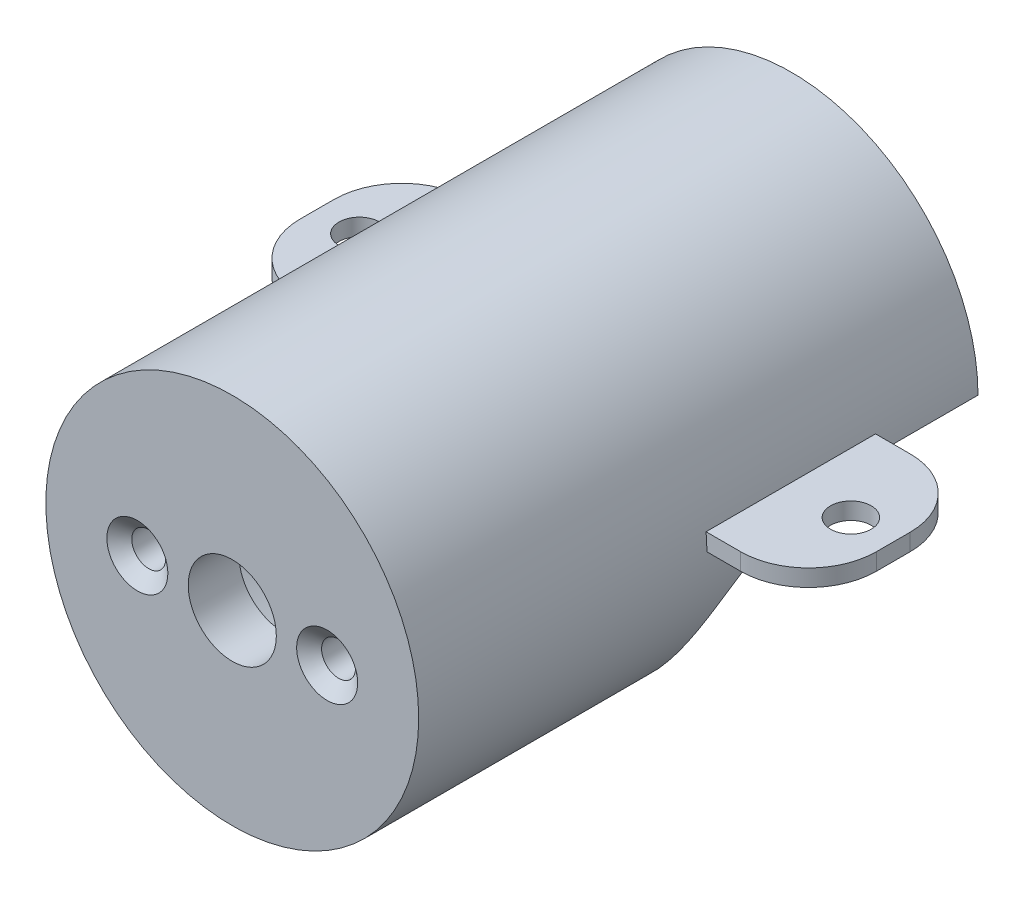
from build123d import *

# Parameters (mm, degrees)
SKETCH1_R                                         = 12.7
BOSS_EXTRUDE1_DEPTH                               = 3.81
SKETCH2_R                                         = 3.302
SKETCH2_R_2                                       = 1.27
CUT_EXTRUDE1_DEPTH                                = 19.360177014
CSK_FOR_0_FLAT_HEAD_MACHINE_SCREW_100_D           = 2.54
CSK_FOR_0_FLAT_HEAD_MACHINE_SCREW_100_CSINK_D     = 4.572
CSK_FOR_0_FLAT_HEAD_MACHINE_SCREW_100_CSINK_ANGLE = 100
CSK_FOR_0_FLAT_HEAD_MACHINE_SCREW_2_D             = 2.54
CSK_FOR_0_FLAT_HEAD_MACHINE_SCREW_2_CSINK_D       = 4.572
CSK_FOR_0_FLAT_HEAD_MACHINE_SCREW_2_CSINK_ANGLE   = 100
BOSS_EXTRUDE4_START                               = -41.91
SKETCH8_R                                         = 13.97
SKETCH8_R_2                                       = 12.7
BOSS_EXTRUDE4_DEPTH                               = 41.91
CUT_EXTRUDE2_DEPTH                                = 43.917732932
CUT_EXTRUDE2_DEPTH_BACK                           = 43.917732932
SKETCH9_W                                         = 10.082430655
SKETCH9_H                                         = 15.310655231
BOSS_EXTRUDE5_DEPTH                               = 1.27
CUT_EXTRUDE3_DEPTH                                = 46.96628112
CUT_EXTRUDE3_DEPTH_BACK                           = 46.96628112
SKETCH12_R                                        = 1.524
CUT_EXTRUDE4_DEPTH                                = 47.368046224


with BuildPart() as part:
    # Sketch1 → Boss-Extrude1 (new body)
    with BuildSketch(Plane.XY):
        with Locations(Location((0, 0, 0), (0, 0, 180))):
            Circle(SKETCH1_R)
    extrude(amount=BOSS_EXTRUDE1_DEPTH)

    # Sketch2 → Cut-Extrude1 (cut, through all)
    with BuildSketch(Plane.XY.offset(3.81)):
        Circle(SKETCH2_R)
        with Locations((-7.112, 0)):
            Circle(SKETCH2_R_2)
        with Locations((7.112, 0)):
            Circle(SKETCH2_R_2)
    extrude(amount=-CUT_EXTRUDE1_DEPTH, mode=Mode.SUBTRACT)

    # CSK for _0 Flat Head Machine Screw _100 (through all)
    with Locations(Plane(origin=(-7.112, 0, 3.81), x_dir=(1, 0, 0), z_dir=(0, 0, 1))):
        with Locations((0, 0), (14.224, 0)):
            CounterSinkHole(CSK_FOR_0_FLAT_HEAD_MACHINE_SCREW_100_D / 2, CSK_FOR_0_FLAT_HEAD_MACHINE_SCREW_100_CSINK_D / 2, counter_sink_angle=CSK_FOR_0_FLAT_HEAD_MACHINE_SCREW_100_CSINK_ANGLE)

    # CSK for _0 Flat Head Machine Screw _ 2 (through all)
    with Locations(Plane(origin=(15.260137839, -5.726214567, 0), x_dir=(1, 0, 0), z_dir=(0, 0, 1))):
        with Locations((0, 0)):
            CounterSinkHole(CSK_FOR_0_FLAT_HEAD_MACHINE_SCREW_2_D / 2, CSK_FOR_0_FLAT_HEAD_MACHINE_SCREW_2_CSINK_D / 2, counter_sink_angle=CSK_FOR_0_FLAT_HEAD_MACHINE_SCREW_2_CSINK_ANGLE)

    # Sketch8 → Boss-Extrude4 (add)
    with BuildSketch(Plane.XY.offset(3.81).offset(BOSS_EXTRUDE4_START)):
        Circle(SKETCH8_R)
        Circle(SKETCH8_R_2, mode=Mode.SUBTRACT)
    extrude(amount=BOSS_EXTRUDE4_DEPTH)

    # Sketch9 → Cut-Extrude2 (cut, two sides: drawn at the far end of the back side and taken through both)
    with BuildSketch(Plane(origin=(0, 0, 0), x_dir=(0, 0, -1), z_dir=(1, 0, 0)).offset(-CUT_EXTRUDE2_DEPTH_BACK)):
        with Locations((35.521215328, -7.655327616)):
            Rectangle(SKETCH9_W, SKETCH9_H)
    extrude(amount=CUT_EXTRUDE2_DEPTH + CUT_EXTRUDE2_DEPTH_BACK, mode=Mode.SUBTRACT)

    # Sketch10 → Boss-Extrude5 (add)
    with BuildSketch(Plane(origin=(0, 0, 0), x_dir=(1, 0, 0), z_dir=(0, 1, 0))):
        with BuildLine():
            Line((-13.97, 30.48), (-16.51, 30.48))
            ThreePointArc((-16.51, 30.48), (-20.102102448, 28.992102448), (-21.59, 25.4))
            Line((-21.59, 25.4), (-21.59, 22.86))
            ThreePointArc((-21.59, 22.86), (-20.102102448, 19.267897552), (-16.51, 17.78))
            Line((-16.51, 17.78), (-13.97, 17.78))
            Line((-13.97, 17.78), (-13.531075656, 17.78))
            Line((-13.531075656, 17.78), (-13.531075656, 30.48))
            Line((-13.531075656, 30.48), (-13.97, 30.48))
        make_face()
        with BuildLine():
            Line((21.59, 25.4), (21.59, 22.86))
            ThreePointArc((21.59, 22.86), (20.102102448, 19.267897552), (16.51, 17.78))
            Line((16.51, 17.78), (13.97, 17.78))
            Line((13.97, 17.78), (13.531075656, 17.78))
            Line((13.531075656, 17.78), (13.531075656, 30.48))
            Line((13.531075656, 30.48), (13.97, 30.48))
            Line((13.97, 30.48), (16.51, 30.48))
            ThreePointArc((16.51, 30.48), (20.102102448, 28.992102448), (21.59, 25.4))
        make_face()
    extrude(amount=BOSS_EXTRUDE5_DEPTH)

    # Sketch11 → Cut-Extrude3 (cut, two sides: drawn at the far end of the back side and taken through both)
    with BuildSketch(Plane(origin=(0, 0, 0), x_dir=(0, 0, -1), z_dir=(1, 0, 0)).offset(-CUT_EXTRUDE3_DEPTH_BACK)):
        with BuildLine():
            Line((30.48, 0), (27.94, 0))
            ThreePointArc((27.94, 0), (20.755795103, -2.975795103), (17.78, -10.16))
            Line((17.78, -10.16), (17.78, -15.017867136))
            Line((17.78, -15.017867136), (32.054824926, -15.017867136))
            Line((32.054824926, -15.017867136), (32.054824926, 0))
            Line((32.054824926, 0), (30.48, 0))
        make_face()
    extrude(amount=CUT_EXTRUDE3_DEPTH + CUT_EXTRUDE3_DEPTH_BACK, mode=Mode.SUBTRACT)

    # Sketch12 → Cut-Extrude4 (cut, through all)
    with BuildSketch(Plane(origin=(0, 1.27, 0), x_dir=(1, 0, 0), z_dir=(0, 1, 0))):
        with Locations(Location((18.415, 24.13, 0), (0, 0, 270))):
            Circle(SKETCH12_R)
        with Locations(Location((-18.415, 24.13, 0), (0, 0, 270))):
            Circle(SKETCH12_R)
    extrude(amount=-CUT_EXTRUDE4_DEPTH, mode=Mode.SUBTRACT)


solid = part.part
